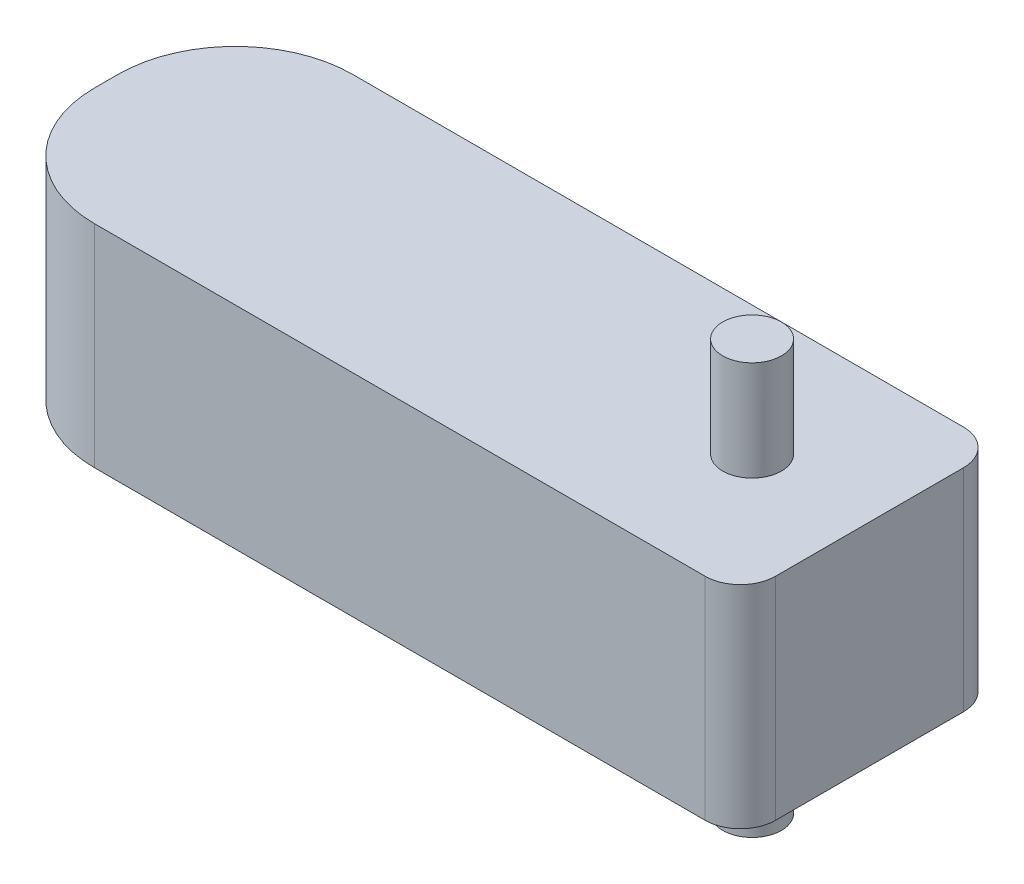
ISO-10303-21;
HEADER;
FILE_DESCRIPTION(('STEP AP214'),'2;1');
FILE_NAME('part.step','',(''),(''),'','','');
FILE_SCHEMA(('AUTOMOTIVE_DESIGN { 1 0 10303 214 1 1 1 1 }'));
ENDSEC;
DATA;
#1=APPLICATION_CONTEXT('core data for automotive mechanical design processes');
#2=APPLICATION_PROTOCOL_DEFINITION('international standard','automotive_design',2000,#1);
#3=PRODUCT_CONTEXT('',#1,'mechanical');
#4=PRODUCT('Part','Part','',(#3));
#5=PRODUCT_RELATED_PRODUCT_CATEGORY('part','',(#4));
#6=PRODUCT_DEFINITION_FORMATION('','',#4);
#7=PRODUCT_DEFINITION_CONTEXT('part definition',#1,'design');
#8=PRODUCT_DEFINITION('design','',#6,#7);
#9=PRODUCT_DEFINITION_SHAPE('','',#8);
#10=(LENGTH_UNIT() NAMED_UNIT(*) SI_UNIT(.MILLI.,.METRE.));
#11=(NAMED_UNIT(*) PLANE_ANGLE_UNIT() SI_UNIT($,.RADIAN.));
#12=(NAMED_UNIT(*) SI_UNIT($,.STERADIAN.) SOLID_ANGLE_UNIT());
#13=UNCERTAINTY_MEASURE_WITH_UNIT(LENGTH_MEASURE(1.E-05),#10,'distance_accuracy_value','');
#14=(GEOMETRIC_REPRESENTATION_CONTEXT(3) GLOBAL_UNCERTAINTY_ASSIGNED_CONTEXT((#13)) GLOBAL_UNIT_ASSIGNED_CONTEXT((#10,
#11,#12)) REPRESENTATION_CONTEXT('',''));
#15=CARTESIAN_POINT('',(0.,0.,0.));
#16=DIRECTION('',(0.,0.,1.));
#17=DIRECTION('',(1.,0.,0.));
#18=AXIS2_PLACEMENT_3D('',#15,#16,#17);
#19=CARTESIAN_POINT('',(0.,18.,0.));
#20=DIRECTION('',(1.,0.,0.));
#21=DIRECTION('',(0.,0.,-1.));
#22=AXIS2_PLACEMENT_3D('',#19,#20,#21);
#23=PLANE('',#22);
#24=DIRECTION('',(0.,0.,1.));
#25=VECTOR('',#24,1.);
#26=CARTESIAN_POINT('',(0.,0.,0.));
#27=LINE('',#26,#25);
#28=CARTESIAN_POINT('',(0.,0.,-12.));
#29=VERTEX_POINT('',#28);
#30=CARTESIAN_POINT('',(0.,0.,-10.));
#31=VERTEX_POINT('',#30);
#32=EDGE_CURVE('E127',#29,#31,#27,.T.);
#33=ORIENTED_EDGE('',*,*,#32,.T.);
#34=DIRECTION('',(0.,-1.,0.));
#35=VECTOR('',#34,1.);
#36=CARTESIAN_POINT('',(0.,18.,-10.));
#37=LINE('',#36,#35);
#38=CARTESIAN_POINT('',(0.,18.,-10.));
#39=VERTEX_POINT('',#38);
#40=EDGE_CURVE('E110',#31,#39,#37,.F.);
#41=ORIENTED_EDGE('',*,*,#40,.T.);
#42=DIRECTION('',(0.,0.,1.));
#43=VECTOR('',#42,1.);
#44=CARTESIAN_POINT('',(0.,18.,0.));
#45=LINE('',#44,#43);
#46=CARTESIAN_POINT('',(0.,18.,-12.));
#47=VERTEX_POINT('',#46);
#48=EDGE_CURVE('E137',#47,#39,#45,.T.);
#49=ORIENTED_EDGE('',*,*,#48,.F.);
#50=DIRECTION('',(0.,-1.,0.));
#51=VECTOR('',#50,1.);
#52=CARTESIAN_POINT('',(0.,18.,-12.));
#53=LINE('',#52,#51);
#54=EDGE_CURVE('E115',#47,#29,#53,.T.);
#55=ORIENTED_EDGE('',*,*,#54,.T.);
#56=EDGE_LOOP('',(#33,#41,#49,#55));
#57=FACE_BOUND('',#56,.T.);
#58=ADVANCED_FACE('F37',(#57),#23,.F.);
#59=CARTESIAN_POINT('',(0.,18.,0.));
#60=DIRECTION('',(0.,0.,-1.));
#61=DIRECTION('',(-1.,0.,0.));
#62=AXIS2_PLACEMENT_3D('',#59,#60,#61);
#63=PLANE('',#62);
#64=DIRECTION('',(1.,0.,0.));
#65=VECTOR('',#64,1.);
#66=CARTESIAN_POINT('',(0.,0.,0.));
#67=LINE('',#66,#65);
#68=CARTESIAN_POINT('',(10.,0.,0.));
#69=VERTEX_POINT('',#68);
#70=CARTESIAN_POINT('',(62.,0.,0.));
#71=VERTEX_POINT('',#70);
#72=EDGE_CURVE('E119',#69,#71,#67,.T.);
#73=ORIENTED_EDGE('',*,*,#72,.T.);
#74=DIRECTION('',(0.,-1.,0.));
#75=VECTOR('',#74,1.);
#76=CARTESIAN_POINT('',(62.,18.,0.));
#77=LINE('',#76,#75);
#78=CARTESIAN_POINT('',(62.,18.,0.));
#79=VERTEX_POINT('',#78);
#80=EDGE_CURVE('E60',#71,#79,#77,.F.);
#81=ORIENTED_EDGE('',*,*,#80,.T.);
#82=DIRECTION('',(1.,0.,0.));
#83=VECTOR('',#82,1.);
#84=CARTESIAN_POINT('',(0.,18.,0.));
#85=LINE('',#84,#83);
#86=CARTESIAN_POINT('',(10.,18.,0.));
#87=VERTEX_POINT('',#86);
#88=EDGE_CURVE('E120',#87,#79,#85,.T.);
#89=ORIENTED_EDGE('',*,*,#88,.F.);
#90=DIRECTION('',(0.,-1.,0.));
#91=VECTOR('',#90,1.);
#92=CARTESIAN_POINT('',(10.,18.,0.));
#93=LINE('',#92,#91);
#94=EDGE_CURVE('E109',#87,#69,#93,.T.);
#95=ORIENTED_EDGE('',*,*,#94,.T.);
#96=EDGE_LOOP('',(#73,#81,#89,#95));
#97=FACE_BOUND('',#96,.T.);
#98=ADVANCED_FACE('F118',(#97),#63,.F.);
#99=CARTESIAN_POINT('',(65.,18.,0.));
#100=DIRECTION('',(-1.,0.,0.));
#101=DIRECTION('',(0.,0.,1.));
#102=AXIS2_PLACEMENT_3D('',#99,#100,#101);
#103=PLANE('',#102);
#104=DIRECTION('',(0.,0.,-1.));
#105=VECTOR('',#104,1.);
#106=CARTESIAN_POINT('',(65.,18.,0.));
#107=LINE('',#106,#105);
#108=CARTESIAN_POINT('',(65.,18.,-3.));
#109=VERTEX_POINT('',#108);
#110=CARTESIAN_POINT('',(65.,18.,-19.));
#111=VERTEX_POINT('',#110);
#112=EDGE_CURVE('E165',#109,#111,#107,.T.);
#113=ORIENTED_EDGE('',*,*,#112,.F.);
#114=DIRECTION('',(0.,-1.,0.));
#115=VECTOR('',#114,1.);
#116=CARTESIAN_POINT('',(65.,18.,-3.));
#117=LINE('',#116,#115);
#118=CARTESIAN_POINT('',(65.,0.,-3.));
#119=VERTEX_POINT('',#118);
#120=EDGE_CURVE('E155',#109,#119,#117,.T.);
#121=ORIENTED_EDGE('',*,*,#120,.T.);
#122=DIRECTION('',(0.,0.,-1.));
#123=VECTOR('',#122,1.);
#124=CARTESIAN_POINT('',(65.,0.,0.));
#125=LINE('',#124,#123);
#126=CARTESIAN_POINT('',(65.,0.,-19.));
#127=VERTEX_POINT('',#126);
#128=EDGE_CURVE('E126',#119,#127,#125,.T.);
#129=ORIENTED_EDGE('',*,*,#128,.T.);
#130=DIRECTION('',(0.,-1.,0.));
#131=VECTOR('',#130,1.);
#132=CARTESIAN_POINT('',(65.,18.,-19.));
#133=LINE('',#132,#131);
#134=EDGE_CURVE('E153',#127,#111,#133,.F.);
#135=ORIENTED_EDGE('',*,*,#134,.T.);
#136=EDGE_LOOP('',(#113,#121,#129,#135));
#137=FACE_BOUND('',#136,.T.);
#138=ADVANCED_FACE('F169',(#137),#103,.F.);
#139=CARTESIAN_POINT('',(0.,18.,-22.));
#140=DIRECTION('',(0.,0.,1.));
#141=DIRECTION('',(1.,0.,0.));
#142=AXIS2_PLACEMENT_3D('',#139,#140,#141);
#143=PLANE('',#142);
#144=DIRECTION('',(-1.,0.,0.));
#145=VECTOR('',#144,1.);
#146=CARTESIAN_POINT('',(0.,18.,-22.));
#147=LINE('',#146,#145);
#148=CARTESIAN_POINT('',(62.,18.,-22.));
#149=VERTEX_POINT('',#148);
#150=CARTESIAN_POINT('',(10.,18.,-22.));
#151=VERTEX_POINT('',#150);
#152=EDGE_CURVE('E139',#149,#151,#147,.T.);
#153=ORIENTED_EDGE('',*,*,#152,.F.);
#154=DIRECTION('',(0.,-1.,0.));
#155=VECTOR('',#154,1.);
#156=CARTESIAN_POINT('',(62.,18.,-22.));
#157=LINE('',#156,#155);
#158=CARTESIAN_POINT('',(62.,0.,-22.));
#159=VERTEX_POINT('',#158);
#160=EDGE_CURVE('E11',#149,#159,#157,.T.);
#161=ORIENTED_EDGE('',*,*,#160,.T.);
#162=DIRECTION('',(-1.,0.,0.));
#163=VECTOR('',#162,1.);
#164=CARTESIAN_POINT('',(0.,0.,-22.));
#165=LINE('',#164,#163);
#166=CARTESIAN_POINT('',(10.,0.,-22.));
#167=VERTEX_POINT('',#166);
#168=EDGE_CURVE('E130',#159,#167,#165,.T.);
#169=ORIENTED_EDGE('',*,*,#168,.T.);
#170=DIRECTION('',(0.,-1.,0.));
#171=VECTOR('',#170,1.);
#172=CARTESIAN_POINT('',(10.,18.,-22.));
#173=LINE('',#172,#171);
#174=EDGE_CURVE('E150',#167,#151,#173,.F.);
#175=ORIENTED_EDGE('',*,*,#174,.T.);
#176=EDGE_LOOP('',(#153,#161,#169,#175));
#177=FACE_BOUND('',#176,.T.);
#178=ADVANCED_FACE('F216',(#177),#143,.F.);
#179=CARTESIAN_POINT('',(0.,18.,0.));
#180=DIRECTION('',(0.,-1.,0.));
#181=DIRECTION('',(0.,0.,-1.));
#182=AXIS2_PLACEMENT_3D('',#179,#180,#181);
#183=PLANE('',#182);
#184=CARTESIAN_POINT('',(55.,18.,-11.));
#185=DIRECTION('',(0.,-1.,0.));
#186=DIRECTION('',(0.,0.,-1.));
#187=AXIS2_PLACEMENT_3D('',#184,#185,#186);
#188=CIRCLE('',#187,2.5);
#189=CARTESIAN_POINT('',(55.,18.,-13.5));
#190=VERTEX_POINT('',#189);
#191=EDGE_CURVE('E121',#190,#190,#188,.F.);
#192=ORIENTED_EDGE('',*,*,#191,.F.);
#193=EDGE_LOOP('',(#192));
#194=FACE_BOUND('',#193,.T.);
#195=ORIENTED_EDGE('',*,*,#88,.T.);
#196=CARTESIAN_POINT('',(62.,18.,-3.));
#197=DIRECTION('',(0.,-1.,0.));
#198=DIRECTION('',(0.,0.,-1.));
#199=AXIS2_PLACEMENT_3D('',#196,#197,#198);
#200=CIRCLE('',#199,3.);
#201=EDGE_CURVE('E45',#79,#109,#200,.F.);
#202=ORIENTED_EDGE('',*,*,#201,.T.);
#203=ORIENTED_EDGE('',*,*,#112,.T.);
#204=CARTESIAN_POINT('',(62.,18.,-19.));
#205=DIRECTION('',(0.,-1.,0.));
#206=DIRECTION('',(0.,0.,-1.));
#207=AXIS2_PLACEMENT_3D('',#204,#205,#206);
#208=CIRCLE('',#207,3.);
#209=EDGE_CURVE('E52',#111,#149,#208,.F.);
#210=ORIENTED_EDGE('',*,*,#209,.T.);
#211=ORIENTED_EDGE('',*,*,#152,.T.);
#212=CARTESIAN_POINT('',(10.,18.,-12.));
#213=DIRECTION('',(0.,-1.,0.));
#214=DIRECTION('',(0.,0.,-1.));
#215=AXIS2_PLACEMENT_3D('',#212,#213,#214);
#216=CIRCLE('',#215,10.);
#217=EDGE_CURVE('E146',#151,#47,#216,.F.);
#218=ORIENTED_EDGE('',*,*,#217,.T.);
#219=ORIENTED_EDGE('',*,*,#48,.T.);
#220=CARTESIAN_POINT('',(10.,18.,-10.));
#221=DIRECTION('',(0.,-1.,0.));
#222=DIRECTION('',(0.,0.,-1.));
#223=AXIS2_PLACEMENT_3D('',#220,#221,#222);
#224=CIRCLE('',#223,10.);
#225=EDGE_CURVE('E148',#39,#87,#224,.F.);
#226=ORIENTED_EDGE('',*,*,#225,.T.);
#227=EDGE_LOOP('',(#195,#202,#203,#210,#211,#218,#219,#226));
#228=FACE_BOUND('',#227,.T.);
#229=ADVANCED_FACE('F164',(#194,#228),#183,.F.);
#230=CARTESIAN_POINT('',(0.,0.,0.));
#231=DIRECTION('',(0.,-1.,0.));
#232=DIRECTION('',(0.,0.,-1.));
#233=AXIS2_PLACEMENT_3D('',#230,#231,#232);
#234=PLANE('',#233);
#235=CARTESIAN_POINT('',(55.,0.,-11.));
#236=DIRECTION('',(0.,-1.,0.));
#237=DIRECTION('',(0.,0.,-1.));
#238=AXIS2_PLACEMENT_3D('',#235,#236,#237);
#239=CIRCLE('',#238,2.5);
#240=CARTESIAN_POINT('',(55.,0.,-13.5));
#241=VERTEX_POINT('',#240);
#242=EDGE_CURVE('E313',#241,#241,#239,.T.);
#243=ORIENTED_EDGE('',*,*,#242,.F.);
#244=EDGE_LOOP('',(#243));
#245=FACE_BOUND('',#244,.T.);
#246=ORIENTED_EDGE('',*,*,#128,.F.);
#247=CARTESIAN_POINT('',(62.,0.,-3.));
#248=DIRECTION('',(0.,-1.,0.));
#249=DIRECTION('',(0.,0.,-1.));
#250=AXIS2_PLACEMENT_3D('',#247,#248,#249);
#251=CIRCLE('',#250,3.);
#252=EDGE_CURVE('E125',#119,#71,#251,.T.);
#253=ORIENTED_EDGE('',*,*,#252,.T.);
#254=ORIENTED_EDGE('',*,*,#72,.F.);
#255=CARTESIAN_POINT('',(10.,0.,-10.));
#256=DIRECTION('',(0.,-1.,0.));
#257=DIRECTION('',(0.,0.,-1.));
#258=AXIS2_PLACEMENT_3D('',#255,#256,#257);
#259=CIRCLE('',#258,10.);
#260=EDGE_CURVE('E105',#69,#31,#259,.T.);
#261=ORIENTED_EDGE('',*,*,#260,.T.);
#262=ORIENTED_EDGE('',*,*,#32,.F.);
#263=CARTESIAN_POINT('',(10.,0.,-12.));
#264=DIRECTION('',(0.,-1.,0.));
#265=DIRECTION('',(0.,0.,-1.));
#266=AXIS2_PLACEMENT_3D('',#263,#264,#265);
#267=CIRCLE('',#266,10.);
#268=EDGE_CURVE('E116',#29,#167,#267,.T.);
#269=ORIENTED_EDGE('',*,*,#268,.T.);
#270=ORIENTED_EDGE('',*,*,#168,.F.);
#271=CARTESIAN_POINT('',(62.,0.,-19.));
#272=DIRECTION('',(0.,-1.,0.));
#273=DIRECTION('',(0.,0.,-1.));
#274=AXIS2_PLACEMENT_3D('',#271,#272,#273);
#275=CIRCLE('',#274,3.);
#276=EDGE_CURVE('E158',#159,#127,#275,.T.);
#277=ORIENTED_EDGE('',*,*,#276,.T.);
#278=EDGE_LOOP('',(#246,#253,#254,#261,#262,#269,#270,#277));
#279=FACE_BOUND('',#278,.T.);
#280=ADVANCED_FACE('F124',(#245,#279),#234,.T.);
#281=CARTESIAN_POINT('',(55.,26.5,-11.));
#282=DIRECTION('',(0.,-1.,0.));
#283=DIRECTION('',(0.,0.,-1.));
#284=AXIS2_PLACEMENT_3D('',#281,#282,#283);
#285=CYLINDRICAL_SURFACE('',#284,2.5);
#286=CARTESIAN_POINT('',(55.,26.5,-11.));
#287=DIRECTION('',(0.,1.,0.));
#288=DIRECTION('',(0.,0.,1.));
#289=AXIS2_PLACEMENT_3D('',#286,#287,#288);
#290=CIRCLE('',#289,2.5);
#291=CARTESIAN_POINT('',(55.,26.5,-8.5));
#292=VERTEX_POINT('',#291);
#293=EDGE_CURVE('E132',#292,#292,#290,.T.);
#294=ORIENTED_EDGE('',*,*,#293,.F.);
#295=EDGE_LOOP('',(#294));
#296=FACE_BOUND('',#295,.T.);
#297=ORIENTED_EDGE('',*,*,#191,.T.);
#298=EDGE_LOOP('',(#297));
#299=FACE_BOUND('',#298,.T.);
#300=ADVANCED_FACE('F209',(#296,#299),#285,.T.);
#301=CARTESIAN_POINT('',(55.,26.5,-11.));
#302=DIRECTION('',(0.,1.,0.));
#303=DIRECTION('',(0.,0.,1.));
#304=AXIS2_PLACEMENT_3D('',#301,#302,#303);
#305=PLANE('',#304);
#306=ORIENTED_EDGE('',*,*,#293,.T.);
#307=EDGE_LOOP('',(#306));
#308=FACE_BOUND('',#307,.T.);
#309=ADVANCED_FACE('F202',(#308),#305,.T.);
#310=CARTESIAN_POINT('',(55.,-8.5,-11.));
#311=DIRECTION('',(0.,1.,0.));
#312=DIRECTION('',(0.,0.,1.));
#313=AXIS2_PLACEMENT_3D('',#310,#311,#312);
#314=CYLINDRICAL_SURFACE('',#313,2.5);
#315=CARTESIAN_POINT('',(55.,-8.5,-11.));
#316=DIRECTION('',(0.,-1.,0.));
#317=DIRECTION('',(0.,0.,-1.));
#318=AXIS2_PLACEMENT_3D('',#315,#316,#317);
#319=CIRCLE('',#318,2.5);
#320=CARTESIAN_POINT('',(55.,-8.5,-13.5));
#321=VERTEX_POINT('',#320);
#322=EDGE_CURVE('E312',#321,#321,#319,.T.);
#323=ORIENTED_EDGE('',*,*,#322,.F.);
#324=EDGE_LOOP('',(#323));
#325=FACE_BOUND('',#324,.T.);
#326=ORIENTED_EDGE('',*,*,#242,.T.);
#327=EDGE_LOOP('',(#326));
#328=FACE_BOUND('',#327,.T.);
#329=ADVANCED_FACE('F196',(#325,#328),#314,.T.);
#330=CARTESIAN_POINT('',(55.,-8.5,-11.));
#331=DIRECTION('',(0.,-1.,0.));
#332=DIRECTION('',(0.,0.,-1.));
#333=AXIS2_PLACEMENT_3D('',#330,#331,#332);
#334=PLANE('',#333);
#335=ORIENTED_EDGE('',*,*,#322,.T.);
#336=EDGE_LOOP('',(#335));
#337=FACE_BOUND('',#336,.T.);
#338=ADVANCED_FACE('F192',(#337),#334,.T.);
#339=CARTESIAN_POINT('',(10.,18.,-10.));
#340=DIRECTION('',(0.,-1.,0.));
#341=DIRECTION('',(0.,0.,-1.));
#342=AXIS2_PLACEMENT_3D('',#339,#340,#341);
#343=CYLINDRICAL_SURFACE('',#342,10.);
#344=ORIENTED_EDGE('',*,*,#225,.F.);
#345=ORIENTED_EDGE('',*,*,#40,.F.);
#346=ORIENTED_EDGE('',*,*,#260,.F.);
#347=ORIENTED_EDGE('',*,*,#94,.F.);
#348=EDGE_LOOP('',(#344,#345,#346,#347));
#349=FACE_BOUND('',#348,.T.);
#350=ADVANCED_FACE('F108',(#349),#343,.T.);
#351=CARTESIAN_POINT('',(10.,18.,-12.));
#352=DIRECTION('',(0.,-1.,0.));
#353=DIRECTION('',(0.,0.,-1.));
#354=AXIS2_PLACEMENT_3D('',#351,#352,#353);
#355=CYLINDRICAL_SURFACE('',#354,10.);
#356=ORIENTED_EDGE('',*,*,#217,.F.);
#357=ORIENTED_EDGE('',*,*,#174,.F.);
#358=ORIENTED_EDGE('',*,*,#268,.F.);
#359=ORIENTED_EDGE('',*,*,#54,.F.);
#360=EDGE_LOOP('',(#356,#357,#358,#359));
#361=FACE_BOUND('',#360,.T.);
#362=ADVANCED_FACE('F174',(#361),#355,.T.);
#363=CARTESIAN_POINT('',(62.,18.,-3.));
#364=DIRECTION('',(0.,-1.,0.));
#365=DIRECTION('',(0.,0.,-1.));
#366=AXIS2_PLACEMENT_3D('',#363,#364,#365);
#367=CYLINDRICAL_SURFACE('',#366,3.);
#368=ORIENTED_EDGE('',*,*,#201,.F.);
#369=ORIENTED_EDGE('',*,*,#80,.F.);
#370=ORIENTED_EDGE('',*,*,#252,.F.);
#371=ORIENTED_EDGE('',*,*,#120,.F.);
#372=EDGE_LOOP('',(#368,#369,#370,#371));
#373=FACE_BOUND('',#372,.T.);
#374=ADVANCED_FACE('F172',(#373),#367,.T.);
#375=CARTESIAN_POINT('',(62.,18.,-19.));
#376=DIRECTION('',(0.,-1.,0.));
#377=DIRECTION('',(0.,0.,-1.));
#378=AXIS2_PLACEMENT_3D('',#375,#376,#377);
#379=CYLINDRICAL_SURFACE('',#378,3.);
#380=ORIENTED_EDGE('',*,*,#209,.F.);
#381=ORIENTED_EDGE('',*,*,#134,.F.);
#382=ORIENTED_EDGE('',*,*,#276,.F.);
#383=ORIENTED_EDGE('',*,*,#160,.F.);
#384=EDGE_LOOP('',(#380,#381,#382,#383));
#385=FACE_BOUND('',#384,.T.);
#386=ADVANCED_FACE('F39',(#385),#379,.T.);
#387=CLOSED_SHELL('',(#58,#98,#138,#178,#229,#280,#300,#309,#329,#338,#350,#362,#374,#386));
#388=MANIFOLD_SOLID_BREP('B2',#387);
#389=ADVANCED_BREP_SHAPE_REPRESENTATION('',(#18,#388),#14);
#390=SHAPE_DEFINITION_REPRESENTATION(#9,#389);
ENDSEC;
END-ISO-10303-21;
